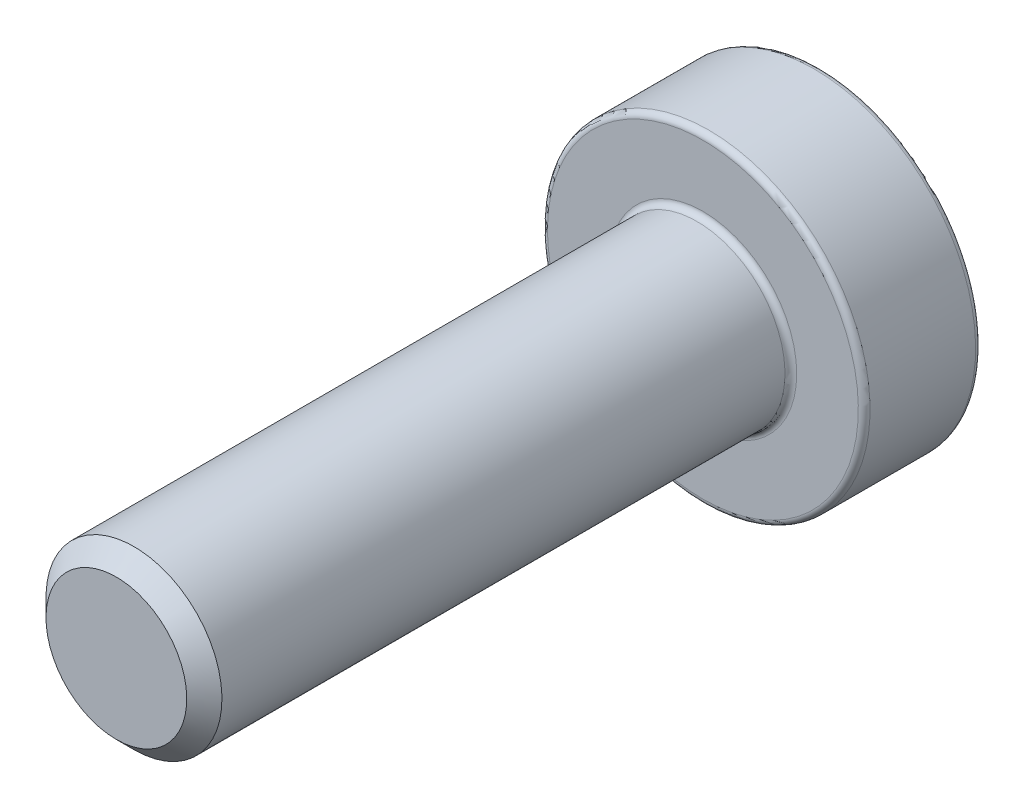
ISO-10303-21;
HEADER;
FILE_DESCRIPTION(('STEP AP214'),'2;1');
FILE_NAME('part.step','',(''),(''),'','','');
FILE_SCHEMA(('AUTOMOTIVE_DESIGN { 1 0 10303 214 1 1 1 1 }'));
ENDSEC;
DATA;
#1=APPLICATION_CONTEXT('core data for automotive mechanical design processes');
#2=APPLICATION_PROTOCOL_DEFINITION('international standard','automotive_design',2000,#1);
#3=PRODUCT_CONTEXT('',#1,'mechanical');
#4=PRODUCT('Part','Part','',(#3));
#5=PRODUCT_RELATED_PRODUCT_CATEGORY('part','',(#4));
#6=PRODUCT_DEFINITION_FORMATION('','',#4);
#7=PRODUCT_DEFINITION_CONTEXT('part definition',#1,'design');
#8=PRODUCT_DEFINITION('design','',#6,#7);
#9=PRODUCT_DEFINITION_SHAPE('','',#8);
#10=(LENGTH_UNIT() NAMED_UNIT(*) SI_UNIT(.MILLI.,.METRE.));
#11=(NAMED_UNIT(*) PLANE_ANGLE_UNIT() SI_UNIT($,.RADIAN.));
#12=(NAMED_UNIT(*) SI_UNIT($,.STERADIAN.) SOLID_ANGLE_UNIT());
#13=UNCERTAINTY_MEASURE_WITH_UNIT(LENGTH_MEASURE(1.E-05),#10,'distance_accuracy_value','');
#14=(GEOMETRIC_REPRESENTATION_CONTEXT(3) GLOBAL_UNCERTAINTY_ASSIGNED_CONTEXT((#13)) GLOBAL_UNIT_ASSIGNED_CONTEXT((#10,
#11,#12)) REPRESENTATION_CONTEXT('',''));
#15=CARTESIAN_POINT('',(0.,0.,0.));
#16=DIRECTION('',(0.,0.,1.));
#17=DIRECTION('',(1.,0.,0.));
#18=AXIS2_PLACEMENT_3D('',#15,#16,#17);
#19=CARTESIAN_POINT('',(0.,2.75,-2.));
#20=DIRECTION('',(0.,0.,-1.));
#21=DIRECTION('',(0.,1.,0.));
#22=AXIS2_PLACEMENT_3D('',#19,#20,#21);
#23=PLANE('',#22);
#24=CARTESIAN_POINT('',(1.575,0.,-2.));
#25=DIRECTION('',(0.,0.,1.));
#26=DIRECTION('',(0.,1.,0.));
#27=AXIS2_PLACEMENT_3D('',#24,#25,#26);
#28=CIRCLE('',#27,0.55);
#29=CARTESIAN_POINT('',(1.31369047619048,0.48396005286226,-2.));
#30=VERTEX_POINT('',#29);
#31=CARTESIAN_POINT('',(1.31369047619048,-0.483960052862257,-2.));
#32=VERTEX_POINT('',#31);
#33=EDGE_CURVE('E183',#30,#32,#28,.T.);
#34=ORIENTED_EDGE('',*,*,#33,.F.);
#35=CARTESIAN_POINT('',(0.,0.,-2.));
#36=DIRECTION('',(0.,0.,-1.));
#37=DIRECTION('',(0.,1.,0.));
#38=AXIS2_PLACEMENT_3D('',#35,#36,#37);
#39=CIRCLE('',#38,1.4);
#40=CARTESIAN_POINT('',(1.07596693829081,0.895709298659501,-2.));
#41=VERTEX_POINT('',#40);
#42=EDGE_CURVE('E180',#41,#30,#39,.T.);
#43=ORIENTED_EDGE('',*,*,#42,.F.);
#44=CARTESIAN_POINT('',(0.787499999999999,1.36399001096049,-2.));
#45=DIRECTION('',(0.,0.,1.));
#46=DIRECTION('',(0.,1.,0.));
#47=AXIS2_PLACEMENT_3D('',#44,#45,#46);
#48=CIRCLE('',#47,0.55);
#49=CARTESIAN_POINT('',(0.237723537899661,1.37966935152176,-2.));
#50=VERTEX_POINT('',#49);
#51=EDGE_CURVE('E178',#50,#41,#48,.T.);
#52=ORIENTED_EDGE('',*,*,#51,.F.);
#53=CARTESIAN_POINT('',(0.,0.,-2.));
#54=DIRECTION('',(0.,0.,-1.));
#55=DIRECTION('',(0.,1.,0.));
#56=AXIS2_PLACEMENT_3D('',#53,#54,#55);
#57=CIRCLE('',#56,1.4);
#58=CARTESIAN_POINT('',(-0.237723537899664,1.37966935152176,-2.));
#59=VERTEX_POINT('',#58);
#60=EDGE_CURVE('E175',#59,#50,#57,.T.);
#61=ORIENTED_EDGE('',*,*,#60,.F.);
#62=CARTESIAN_POINT('',(-0.787500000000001,1.36399001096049,-2.));
#63=DIRECTION('',(0.,0.,1.));
#64=DIRECTION('',(0.,1.,0.));
#65=AXIS2_PLACEMENT_3D('',#62,#63,#64);
#66=CIRCLE('',#65,0.55);
#67=CARTESIAN_POINT('',(-1.07596693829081,0.895709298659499,-2.));
#68=VERTEX_POINT('',#67);
#69=EDGE_CURVE('E173',#68,#59,#66,.T.);
#70=ORIENTED_EDGE('',*,*,#69,.F.);
#71=CARTESIAN_POINT('',(0.,0.,-2.));
#72=DIRECTION('',(0.,0.,-1.));
#73=DIRECTION('',(0.,1.,0.));
#74=AXIS2_PLACEMENT_3D('',#71,#72,#73);
#75=CIRCLE('',#74,1.4);
#76=CARTESIAN_POINT('',(-1.31369047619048,0.483960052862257,-2.));
#77=VERTEX_POINT('',#76);
#78=EDGE_CURVE('E170',#77,#68,#75,.T.);
#79=ORIENTED_EDGE('',*,*,#78,.F.);
#80=CARTESIAN_POINT('',(-1.575,0.,-2.));
#81=DIRECTION('',(0.,0.,1.));
#82=DIRECTION('',(0.,1.,0.));
#83=AXIS2_PLACEMENT_3D('',#80,#81,#82);
#84=CIRCLE('',#83,0.55);
#85=CARTESIAN_POINT('',(-1.31369047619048,-0.48396005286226,-2.));
#86=VERTEX_POINT('',#85);
#87=EDGE_CURVE('E168',#86,#77,#84,.T.);
#88=ORIENTED_EDGE('',*,*,#87,.F.);
#89=CARTESIAN_POINT('',(0.,0.,-2.));
#90=DIRECTION('',(0.,0.,-1.));
#91=DIRECTION('',(0.,1.,0.));
#92=AXIS2_PLACEMENT_3D('',#89,#90,#91);
#93=CIRCLE('',#92,1.4);
#94=CARTESIAN_POINT('',(-1.07596693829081,-0.895709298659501,-2.));
#95=VERTEX_POINT('',#94);
#96=EDGE_CURVE('E144',#95,#86,#93,.T.);
#97=ORIENTED_EDGE('',*,*,#96,.F.);
#98=CARTESIAN_POINT('',(-0.787499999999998,-1.36399001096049,-2.));
#99=DIRECTION('',(0.,0.,1.));
#100=DIRECTION('',(0.,1.,0.));
#101=AXIS2_PLACEMENT_3D('',#98,#99,#100);
#102=CIRCLE('',#101,0.55);
#103=CARTESIAN_POINT('',(-0.237723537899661,-1.37966935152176,-2.));
#104=VERTEX_POINT('',#103);
#105=EDGE_CURVE('E138',#104,#95,#102,.T.);
#106=ORIENTED_EDGE('',*,*,#105,.F.);
#107=CARTESIAN_POINT('',(0.,0.,-2.));
#108=DIRECTION('',(0.,0.,-1.));
#109=DIRECTION('',(0.,1.,0.));
#110=AXIS2_PLACEMENT_3D('',#107,#108,#109);
#111=CIRCLE('',#110,1.4);
#112=CARTESIAN_POINT('',(0.237723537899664,-1.37966935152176,-2.));
#113=VERTEX_POINT('',#112);
#114=EDGE_CURVE('E142',#113,#104,#111,.T.);
#115=ORIENTED_EDGE('',*,*,#114,.F.);
#116=CARTESIAN_POINT('',(0.787500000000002,-1.36399001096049,-2.));
#117=DIRECTION('',(0.,0.,1.));
#118=DIRECTION('',(0.,1.,0.));
#119=AXIS2_PLACEMENT_3D('',#116,#117,#118);
#120=CIRCLE('',#119,0.55);
#121=CARTESIAN_POINT('',(1.07596693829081,-0.895709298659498,-2.));
#122=VERTEX_POINT('',#121);
#123=EDGE_CURVE('E188',#122,#113,#120,.T.);
#124=ORIENTED_EDGE('',*,*,#123,.F.);
#125=CARTESIAN_POINT('',(0.,0.,-2.));
#126=DIRECTION('',(0.,0.,-1.));
#127=DIRECTION('',(0.,1.,0.));
#128=AXIS2_PLACEMENT_3D('',#125,#126,#127);
#129=CIRCLE('',#128,1.4);
#130=EDGE_CURVE('E185',#32,#122,#129,.T.);
#131=ORIENTED_EDGE('',*,*,#130,.F.);
#132=EDGE_LOOP('',(#34,#43,#52,#61,#70,#79,#88,#97,#106,#115,#124,#131));
#133=FACE_BOUND('',#132,.T.);
#134=CARTESIAN_POINT('',(0.,0.,-2.));
#135=DIRECTION('',(0.,0.,-1.));
#136=DIRECTION('',(0.,1.,0.));
#137=AXIS2_PLACEMENT_3D('',#134,#135,#136);
#138=CIRCLE('',#137,2.65);
#139=CARTESIAN_POINT('',(0.,2.65,-2.));
#140=VERTEX_POINT('',#139);
#141=EDGE_CURVE('E257',#140,#140,#138,.T.);
#142=ORIENTED_EDGE('',*,*,#141,.T.);
#143=EDGE_LOOP('',(#142));
#144=FACE_BOUND('',#143,.T.);
#145=ADVANCED_FACE('F31',(#133,#144),#23,.T.);
#146=CARTESIAN_POINT('',(0.,0.,-2.));
#147=DIRECTION('',(0.,0.,-1.));
#148=DIRECTION('',(0.,1.,0.));
#149=AXIS2_PLACEMENT_3D('',#146,#147,#148);
#150=CYLINDRICAL_SURFACE('',#149,2.75);
#151=CARTESIAN_POINT('',(0.,0.,-1.9));
#152=DIRECTION('',(0.,0.,-1.));
#153=DIRECTION('',(0.,1.,0.));
#154=AXIS2_PLACEMENT_3D('',#151,#152,#153);
#155=CIRCLE('',#154,2.75);
#156=CARTESIAN_POINT('',(0.,2.75,-1.9));
#157=VERTEX_POINT('',#156);
#158=EDGE_CURVE('E264',#157,#157,#155,.F.);
#159=ORIENTED_EDGE('',*,*,#158,.T.);
#160=EDGE_LOOP('',(#159));
#161=FACE_BOUND('',#160,.T.);
#162=CARTESIAN_POINT('',(0.,0.,-0.1));
#163=DIRECTION('',(0.,0.,1.));
#164=DIRECTION('',(0.,-1.,0.));
#165=AXIS2_PLACEMENT_3D('',#162,#163,#164);
#166=CIRCLE('',#165,2.75);
#167=CARTESIAN_POINT('',(0.,-2.75,-0.100000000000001));
#168=VERTEX_POINT('',#167);
#169=EDGE_CURVE('E261',#168,#168,#166,.F.);
#170=ORIENTED_EDGE('',*,*,#169,.T.);
#171=EDGE_LOOP('',(#170));
#172=FACE_BOUND('',#171,.T.);
#173=ADVANCED_FACE('F294',(#161,#172),#150,.T.);
#174=CARTESIAN_POINT('',(0.,1.5,0.));
#175=DIRECTION('',(0.,0.,1.));
#176=DIRECTION('',(0.,-1.,0.));
#177=AXIS2_PLACEMENT_3D('',#174,#175,#176);
#178=PLANE('',#177);
#179=CARTESIAN_POINT('',(0.,0.,0.));
#180=DIRECTION('',(0.,0.,1.));
#181=DIRECTION('',(0.,-1.,0.));
#182=AXIS2_PLACEMENT_3D('',#179,#180,#181);
#183=CIRCLE('',#182,2.65);
#184=CARTESIAN_POINT('',(0.,-2.65,0.));
#185=VERTEX_POINT('',#184);
#186=EDGE_CURVE('E270',#185,#185,#183,.T.);
#187=ORIENTED_EDGE('',*,*,#186,.T.);
#188=EDGE_LOOP('',(#187));
#189=FACE_BOUND('',#188,.T.);
#190=CARTESIAN_POINT('',(0.,0.,0.));
#191=DIRECTION('',(0.,0.,1.));
#192=DIRECTION('',(0.,-1.,0.));
#193=AXIS2_PLACEMENT_3D('',#190,#191,#192);
#194=CIRCLE('',#193,1.6);
#195=CARTESIAN_POINT('',(0.,-1.6,0.));
#196=VERTEX_POINT('',#195);
#197=EDGE_CURVE('E267',#196,#196,#194,.F.);
#198=ORIENTED_EDGE('',*,*,#197,.T.);
#199=EDGE_LOOP('',(#198));
#200=FACE_BOUND('',#199,.T.);
#201=ADVANCED_FACE('F298',(#189,#200),#178,.T.);
#202=CARTESIAN_POINT('',(0.,0.,-2.));
#203=DIRECTION('',(0.,0.,-1.));
#204=DIRECTION('',(0.,1.,0.));
#205=AXIS2_PLACEMENT_3D('',#202,#203,#204);
#206=CYLINDRICAL_SURFACE('',#205,1.5);
#207=CARTESIAN_POINT('',(0.,0.,9.7));
#208=DIRECTION('',(0.,0.,1.));
#209=DIRECTION('',(0.,-1.,0.));
#210=AXIS2_PLACEMENT_3D('',#207,#208,#209);
#211=CIRCLE('',#210,1.5);
#212=CARTESIAN_POINT('',(0.,-1.5,9.7));
#213=VERTEX_POINT('',#212);
#214=EDGE_CURVE('E38',#213,#213,#211,.F.);
#215=ORIENTED_EDGE('',*,*,#214,.T.);
#216=EDGE_LOOP('',(#215));
#217=FACE_BOUND('',#216,.T.);
#218=CARTESIAN_POINT('',(0.,0.,0.0999999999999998));
#219=DIRECTION('',(0.,0.,1.));
#220=DIRECTION('',(0.,-1.,0.));
#221=AXIS2_PLACEMENT_3D('',#218,#219,#220);
#222=CIRCLE('',#221,1.5);
#223=CARTESIAN_POINT('',(0.,-1.5,0.0999999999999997));
#224=VERTEX_POINT('',#223);
#225=EDGE_CURVE('E273',#224,#224,#222,.T.);
#226=ORIENTED_EDGE('',*,*,#225,.T.);
#227=EDGE_LOOP('',(#226));
#228=FACE_BOUND('',#227,.T.);
#229=ADVANCED_FACE('F278',(#217,#228),#206,.T.);
#230=CARTESIAN_POINT('',(0.,0.,10.));
#231=DIRECTION('',(0.,0.,1.));
#232=DIRECTION('',(0.,-1.,0.));
#233=AXIS2_PLACEMENT_3D('',#230,#231,#232);
#234=PLANE('',#233);
#235=CARTESIAN_POINT('',(0.,0.,10.));
#236=DIRECTION('',(0.,0.,1.));
#237=DIRECTION('',(0.,-1.,0.));
#238=AXIS2_PLACEMENT_3D('',#235,#236,#237);
#239=CIRCLE('',#238,1.2);
#240=CARTESIAN_POINT('',(0.,-1.2,10.));
#241=VERTEX_POINT('',#240);
#242=EDGE_CURVE('E11',#241,#241,#239,.T.);
#243=ORIENTED_EDGE('',*,*,#242,.T.);
#244=EDGE_LOOP('',(#243));
#245=FACE_BOUND('',#244,.T.);
#246=ADVANCED_FACE('F309',(#245),#234,.T.);
#247=CARTESIAN_POINT('',(0.,0.,-1.9));
#248=DIRECTION('',(0.,0.,-1.));
#249=DIRECTION('',(0.,1.,0.));
#250=AXIS2_PLACEMENT_3D('',#247,#248,#249);
#251=TOROIDAL_SURFACE('',#250,2.65,0.1);
#252=ORIENTED_EDGE('',*,*,#158,.F.);
#253=EDGE_LOOP('',(#252));
#254=FACE_BOUND('',#253,.T.);
#255=ORIENTED_EDGE('',*,*,#141,.F.);
#256=EDGE_LOOP('',(#255));
#257=FACE_BOUND('',#256,.T.);
#258=ADVANCED_FACE('F312',(#254,#257),#251,.T.);
#259=CARTESIAN_POINT('',(0.,0.,-0.1));
#260=DIRECTION('',(0.,0.,1.));
#261=DIRECTION('',(0.,-1.,0.));
#262=AXIS2_PLACEMENT_3D('',#259,#260,#261);
#263=TOROIDAL_SURFACE('',#262,2.65,0.1);
#264=ORIENTED_EDGE('',*,*,#186,.F.);
#265=EDGE_LOOP('',(#264));
#266=FACE_BOUND('',#265,.T.);
#267=ORIENTED_EDGE('',*,*,#169,.F.);
#268=EDGE_LOOP('',(#267));
#269=FACE_BOUND('',#268,.T.);
#270=ADVANCED_FACE('F316',(#266,#269),#263,.T.);
#271=CARTESIAN_POINT('',(0.,0.,0.0999999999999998));
#272=DIRECTION('',(0.,0.,1.));
#273=DIRECTION('',(0.,-1.,0.));
#274=AXIS2_PLACEMENT_3D('',#271,#272,#273);
#275=TOROIDAL_SURFACE('',#274,1.6,0.1);
#276=ORIENTED_EDGE('',*,*,#225,.F.);
#277=EDGE_LOOP('',(#276));
#278=FACE_BOUND('',#277,.T.);
#279=ORIENTED_EDGE('',*,*,#197,.F.);
#280=EDGE_LOOP('',(#279));
#281=FACE_BOUND('',#280,.T.);
#282=ADVANCED_FACE('F320',(#278,#281),#275,.F.);
#283=CARTESIAN_POINT('',(0.787500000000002,-1.36399001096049,-0.9));
#284=DIRECTION('',(0.,0.,-1.));
#285=DIRECTION('',(0.,1.,0.));
#286=AXIS2_PLACEMENT_3D('',#283,#284,#285);
#287=CYLINDRICAL_SURFACE('',#286,0.55);
#288=CARTESIAN_POINT('',(0.787500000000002,-1.36399001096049,-0.9));
#289=DIRECTION('',(0.,0.,1.));
#290=DIRECTION('',(0.,1.,0.));
#291=AXIS2_PLACEMENT_3D('',#288,#289,#290);
#292=CIRCLE('',#291,0.55);
#293=CARTESIAN_POINT('',(1.07596693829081,-0.895709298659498,-0.9));
#294=VERTEX_POINT('',#293);
#295=CARTESIAN_POINT('',(0.512500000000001,-0.887676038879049,-0.9));
#296=VERTEX_POINT('',#295);
#297=EDGE_CURVE('E159',#294,#296,#292,.T.);
#298=ORIENTED_EDGE('',*,*,#297,.F.);
#299=DIRECTION('',(0.,0.,-1.));
#300=VECTOR('',#299,1.);
#301=CARTESIAN_POINT('',(1.07596693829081,-0.895709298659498,-0.9));
#302=LINE('',#301,#300);
#303=EDGE_CURVE('E227',#294,#122,#302,.T.);
#304=ORIENTED_EDGE('',*,*,#303,.T.);
#305=ORIENTED_EDGE('',*,*,#123,.T.);
#306=DIRECTION('',(0.,0.,-1.));
#307=VECTOR('',#306,1.);
#308=CARTESIAN_POINT('',(0.237723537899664,-1.37966935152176,-0.9));
#309=LINE('',#308,#307);
#310=CARTESIAN_POINT('',(0.237723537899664,-1.37966935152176,-0.9));
#311=VERTEX_POINT('',#310);
#312=EDGE_CURVE('E164',#311,#113,#309,.T.);
#313=ORIENTED_EDGE('',*,*,#312,.F.);
#314=EDGE_CURVE('E222',#296,#311,#292,.T.);
#315=ORIENTED_EDGE('',*,*,#314,.F.);
#316=EDGE_LOOP('',(#298,#304,#305,#313,#315));
#317=FACE_BOUND('',#316,.T.);
#318=ADVANCED_FACE('F323',(#317),#287,.T.);
#319=CARTESIAN_POINT('',(1.575,0.,-0.9));
#320=DIRECTION('',(0.,0.,-1.));
#321=DIRECTION('',(0.,1.,0.));
#322=AXIS2_PLACEMENT_3D('',#319,#320,#321);
#323=CYLINDRICAL_SURFACE('',#322,0.55);
#324=CARTESIAN_POINT('',(1.575,0.,-0.9));
#325=DIRECTION('',(0.,0.,1.));
#326=DIRECTION('',(0.,1.,0.));
#327=AXIS2_PLACEMENT_3D('',#324,#325,#326);
#328=CIRCLE('',#327,0.55);
#329=CARTESIAN_POINT('',(1.31369047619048,0.48396005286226,-0.9));
#330=VERTEX_POINT('',#329);
#331=CARTESIAN_POINT('',(1.025,0.,-0.9));
#332=VERTEX_POINT('',#331);
#333=EDGE_CURVE('E216',#330,#332,#328,.T.);
#334=ORIENTED_EDGE('',*,*,#333,.F.);
#335=DIRECTION('',(0.,0.,-1.));
#336=VECTOR('',#335,1.);
#337=CARTESIAN_POINT('',(1.31369047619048,0.48396005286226,-0.9));
#338=LINE('',#337,#336);
#339=EDGE_CURVE('E233',#330,#30,#338,.T.);
#340=ORIENTED_EDGE('',*,*,#339,.T.);
#341=ORIENTED_EDGE('',*,*,#33,.T.);
#342=DIRECTION('',(0.,0.,-1.));
#343=VECTOR('',#342,1.);
#344=CARTESIAN_POINT('',(1.31369047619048,-0.483960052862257,-0.9));
#345=LINE('',#344,#343);
#346=CARTESIAN_POINT('',(1.31369047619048,-0.483960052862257,-0.9));
#347=VERTEX_POINT('',#346);
#348=EDGE_CURVE('E230',#347,#32,#345,.T.);
#349=ORIENTED_EDGE('',*,*,#348,.F.);
#350=EDGE_CURVE('E215',#332,#347,#328,.T.);
#351=ORIENTED_EDGE('',*,*,#350,.F.);
#352=EDGE_LOOP('',(#334,#340,#341,#349,#351));
#353=FACE_BOUND('',#352,.T.);
#354=ADVANCED_FACE('F356',(#353),#323,.T.);
#355=CARTESIAN_POINT('',(0.787499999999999,1.36399001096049,-0.9));
#356=DIRECTION('',(0.,0.,-1.));
#357=DIRECTION('',(0.,1.,0.));
#358=AXIS2_PLACEMENT_3D('',#355,#356,#357);
#359=CYLINDRICAL_SURFACE('',#358,0.55);
#360=CARTESIAN_POINT('',(0.787499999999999,1.36399001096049,-0.9));
#361=DIRECTION('',(0.,0.,1.));
#362=DIRECTION('',(0.,1.,0.));
#363=AXIS2_PLACEMENT_3D('',#360,#361,#362);
#364=CIRCLE('',#363,0.55);
#365=CARTESIAN_POINT('',(0.237723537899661,1.37966935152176,-0.9));
#366=VERTEX_POINT('',#365);
#367=CARTESIAN_POINT('',(0.512499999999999,0.88767603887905,-0.9));
#368=VERTEX_POINT('',#367);
#369=EDGE_CURVE('E45',#366,#368,#364,.T.);
#370=ORIENTED_EDGE('',*,*,#369,.F.);
#371=DIRECTION('',(0.,0.,-1.));
#372=VECTOR('',#371,1.);
#373=CARTESIAN_POINT('',(0.237723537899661,1.37966935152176,-0.9));
#374=LINE('',#373,#372);
#375=EDGE_CURVE('E239',#366,#50,#374,.T.);
#376=ORIENTED_EDGE('',*,*,#375,.T.);
#377=ORIENTED_EDGE('',*,*,#51,.T.);
#378=DIRECTION('',(0.,0.,-1.));
#379=VECTOR('',#378,1.);
#380=CARTESIAN_POINT('',(1.07596693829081,0.895709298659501,-0.9));
#381=LINE('',#380,#379);
#382=CARTESIAN_POINT('',(1.07596693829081,0.895709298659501,-0.9));
#383=VERTEX_POINT('',#382);
#384=EDGE_CURVE('E236',#383,#41,#381,.T.);
#385=ORIENTED_EDGE('',*,*,#384,.F.);
#386=EDGE_CURVE('E210',#368,#383,#364,.T.);
#387=ORIENTED_EDGE('',*,*,#386,.F.);
#388=EDGE_LOOP('',(#370,#376,#377,#385,#387));
#389=FACE_BOUND('',#388,.T.);
#390=ADVANCED_FACE('F348',(#389),#359,.T.);
#391=CARTESIAN_POINT('',(-0.787500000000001,1.36399001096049,-0.9));
#392=DIRECTION('',(0.,0.,-1.));
#393=DIRECTION('',(0.,1.,0.));
#394=AXIS2_PLACEMENT_3D('',#391,#392,#393);
#395=CYLINDRICAL_SURFACE('',#394,0.55);
#396=CARTESIAN_POINT('',(-0.787500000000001,1.36399001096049,-0.9));
#397=DIRECTION('',(0.,0.,1.));
#398=DIRECTION('',(0.,1.,0.));
#399=AXIS2_PLACEMENT_3D('',#396,#397,#398);
#400=CIRCLE('',#399,0.55);
#401=CARTESIAN_POINT('',(-1.07596693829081,0.895709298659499,-0.9));
#402=VERTEX_POINT('',#401);
#403=CARTESIAN_POINT('',(-0.512500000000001,0.887676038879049,-0.9));
#404=VERTEX_POINT('',#403);
#405=EDGE_CURVE('E205',#402,#404,#400,.T.);
#406=ORIENTED_EDGE('',*,*,#405,.F.);
#407=DIRECTION('',(0.,0.,-1.));
#408=VECTOR('',#407,1.);
#409=CARTESIAN_POINT('',(-1.07596693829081,0.895709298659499,-0.9));
#410=LINE('',#409,#408);
#411=EDGE_CURVE('E245',#402,#68,#410,.T.);
#412=ORIENTED_EDGE('',*,*,#411,.T.);
#413=ORIENTED_EDGE('',*,*,#69,.T.);
#414=DIRECTION('',(0.,0.,-1.));
#415=VECTOR('',#414,1.);
#416=CARTESIAN_POINT('',(-0.237723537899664,1.37966935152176,-0.9));
#417=LINE('',#416,#415);
#418=CARTESIAN_POINT('',(-0.237723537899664,1.37966935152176,-0.9));
#419=VERTEX_POINT('',#418);
#420=EDGE_CURVE('E242',#419,#59,#417,.T.);
#421=ORIENTED_EDGE('',*,*,#420,.F.);
#422=EDGE_CURVE('E204',#404,#419,#400,.T.);
#423=ORIENTED_EDGE('',*,*,#422,.F.);
#424=EDGE_LOOP('',(#406,#412,#413,#421,#423));
#425=FACE_BOUND('',#424,.T.);
#426=ADVANCED_FACE('F340',(#425),#395,.T.);
#427=CARTESIAN_POINT('',(-1.575,0.,-0.9));
#428=DIRECTION('',(0.,0.,-1.));
#429=DIRECTION('',(0.,1.,0.));
#430=AXIS2_PLACEMENT_3D('',#427,#428,#429);
#431=CYLINDRICAL_SURFACE('',#430,0.55);
#432=CARTESIAN_POINT('',(-1.575,0.,-0.9));
#433=DIRECTION('',(0.,0.,1.));
#434=DIRECTION('',(0.,1.,0.));
#435=AXIS2_PLACEMENT_3D('',#432,#433,#434);
#436=CIRCLE('',#435,0.55);
#437=CARTESIAN_POINT('',(-1.31369047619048,-0.48396005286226,-0.9));
#438=VERTEX_POINT('',#437);
#439=CARTESIAN_POINT('',(-1.025,0.,-0.9));
#440=VERTEX_POINT('',#439);
#441=EDGE_CURVE('E198',#438,#440,#436,.T.);
#442=ORIENTED_EDGE('',*,*,#441,.F.);
#443=DIRECTION('',(0.,0.,-1.));
#444=VECTOR('',#443,1.);
#445=CARTESIAN_POINT('',(-1.31369047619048,-0.48396005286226,-0.9));
#446=LINE('',#445,#444);
#447=EDGE_CURVE('E250',#438,#86,#446,.T.);
#448=ORIENTED_EDGE('',*,*,#447,.T.);
#449=ORIENTED_EDGE('',*,*,#87,.T.);
#450=DIRECTION('',(0.,0.,-1.));
#451=VECTOR('',#450,1.);
#452=CARTESIAN_POINT('',(-1.31369047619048,0.483960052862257,-0.9));
#453=LINE('',#452,#451);
#454=CARTESIAN_POINT('',(-1.31369047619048,0.483960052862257,-0.9));
#455=VERTEX_POINT('',#454);
#456=EDGE_CURVE('E247',#455,#77,#453,.T.);
#457=ORIENTED_EDGE('',*,*,#456,.F.);
#458=EDGE_CURVE('E197',#440,#455,#436,.T.);
#459=ORIENTED_EDGE('',*,*,#458,.F.);
#460=EDGE_LOOP('',(#442,#448,#449,#457,#459));
#461=FACE_BOUND('',#460,.T.);
#462=ADVANCED_FACE('F333',(#461),#431,.T.);
#463=CARTESIAN_POINT('',(-0.787499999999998,-1.36399001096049,-0.9));
#464=DIRECTION('',(0.,0.,-1.));
#465=DIRECTION('',(0.,1.,0.));
#466=AXIS2_PLACEMENT_3D('',#463,#464,#465);
#467=CYLINDRICAL_SURFACE('',#466,0.55);
#468=CARTESIAN_POINT('',(-0.787499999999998,-1.36399001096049,-0.9));
#469=DIRECTION('',(0.,0.,1.));
#470=DIRECTION('',(0.,1.,0.));
#471=AXIS2_PLACEMENT_3D('',#468,#469,#470);
#472=CIRCLE('',#471,0.55);
#473=CARTESIAN_POINT('',(-0.237723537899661,-1.37966935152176,-0.9));
#474=VERTEX_POINT('',#473);
#475=CARTESIAN_POINT('',(-0.512499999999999,-0.88767603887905,-0.9));
#476=VERTEX_POINT('',#475);
#477=EDGE_CURVE('E154',#474,#476,#472,.T.);
#478=ORIENTED_EDGE('',*,*,#477,.F.);
#479=DIRECTION('',(0.,0.,-1.));
#480=VECTOR('',#479,1.);
#481=CARTESIAN_POINT('',(-0.237723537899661,-1.37966935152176,-0.9));
#482=LINE('',#481,#480);
#483=EDGE_CURVE('E150',#474,#104,#482,.T.);
#484=ORIENTED_EDGE('',*,*,#483,.T.);
#485=ORIENTED_EDGE('',*,*,#105,.T.);
#486=DIRECTION('',(0.,0.,-1.));
#487=VECTOR('',#486,1.);
#488=CARTESIAN_POINT('',(-1.07596693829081,-0.895709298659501,-0.9));
#489=LINE('',#488,#487);
#490=CARTESIAN_POINT('',(-1.07596693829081,-0.895709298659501,-0.9));
#491=VERTEX_POINT('',#490);
#492=EDGE_CURVE('E158',#491,#95,#489,.T.);
#493=ORIENTED_EDGE('',*,*,#492,.F.);
#494=EDGE_CURVE('E192',#476,#491,#472,.T.);
#495=ORIENTED_EDGE('',*,*,#494,.F.);
#496=EDGE_LOOP('',(#478,#484,#485,#493,#495));
#497=FACE_BOUND('',#496,.T.);
#498=ADVANCED_FACE('F151',(#497),#467,.T.);
#499=CARTESIAN_POINT('',(-0.393749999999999,-0.681995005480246,-0.9));
#500=DIRECTION('',(0.,0.,-1.));
#501=DIRECTION('',(0.,1.,0.));
#502=AXIS2_PLACEMENT_3D('',#499,#500,#501);
#503=PLANE('',#502);
#504=CARTESIAN_POINT('',(0.,0.,-0.9));
#505=DIRECTION('',(0.,0.,-1.));
#506=DIRECTION('',(0.,1.,0.));
#507=AXIS2_PLACEMENT_3D('',#504,#505,#506);
#508=CIRCLE('',#507,1.025);
#509=EDGE_CURVE('E389',#440,#404,#508,.T.);
#510=ORIENTED_EDGE('',*,*,#509,.F.);
#511=ORIENTED_EDGE('',*,*,#458,.T.);
#512=CARTESIAN_POINT('',(0.,0.,-0.9));
#513=DIRECTION('',(0.,0.,-1.));
#514=DIRECTION('',(0.,1.,0.));
#515=AXIS2_PLACEMENT_3D('',#512,#513,#514);
#516=CIRCLE('',#515,1.4);
#517=EDGE_CURVE('E201',#455,#402,#516,.T.);
#518=ORIENTED_EDGE('',*,*,#517,.T.);
#519=ORIENTED_EDGE('',*,*,#405,.T.);
#520=EDGE_LOOP('',(#510,#511,#518,#519));
#521=FACE_BOUND('',#520,.T.);
#522=ADVANCED_FACE('F332',(#521),#503,.T.);
#523=EDGE_CURVE('E396',#476,#440,#508,.T.);
#524=ORIENTED_EDGE('',*,*,#523,.F.);
#525=ORIENTED_EDGE('',*,*,#494,.T.);
#526=CARTESIAN_POINT('',(0.,0.,-0.9));
#527=DIRECTION('',(0.,0.,-1.));
#528=DIRECTION('',(0.,1.,0.));
#529=AXIS2_PLACEMENT_3D('',#526,#527,#528);
#530=CIRCLE('',#529,1.4);
#531=EDGE_CURVE('E194',#491,#438,#530,.T.);
#532=ORIENTED_EDGE('',*,*,#531,.T.);
#533=ORIENTED_EDGE('',*,*,#441,.T.);
#534=EDGE_LOOP('',(#524,#525,#532,#533));
#535=FACE_BOUND('',#534,.T.);
#536=ADVANCED_FACE('F370',(#535),#503,.T.);
#537=EDGE_CURVE('E397',#296,#476,#508,.T.);
#538=ORIENTED_EDGE('',*,*,#537,.F.);
#539=ORIENTED_EDGE('',*,*,#314,.T.);
#540=CARTESIAN_POINT('',(0.,0.,-0.9));
#541=DIRECTION('',(0.,0.,-1.));
#542=DIRECTION('',(0.,1.,0.));
#543=AXIS2_PLACEMENT_3D('',#540,#541,#542);
#544=CIRCLE('',#543,1.4);
#545=EDGE_CURVE('E190',#311,#474,#544,.T.);
#546=ORIENTED_EDGE('',*,*,#545,.T.);
#547=ORIENTED_EDGE('',*,*,#477,.T.);
#548=EDGE_LOOP('',(#538,#539,#546,#547));
#549=FACE_BOUND('',#548,.T.);
#550=ADVANCED_FACE('F375',(#549),#503,.T.);
#551=EDGE_CURVE('E258',#332,#296,#508,.T.);
#552=ORIENTED_EDGE('',*,*,#551,.F.);
#553=ORIENTED_EDGE('',*,*,#350,.T.);
#554=CARTESIAN_POINT('',(0.,0.,-0.9));
#555=DIRECTION('',(0.,0.,-1.));
#556=DIRECTION('',(0.,1.,0.));
#557=AXIS2_PLACEMENT_3D('',#554,#555,#556);
#558=CIRCLE('',#557,1.4);
#559=EDGE_CURVE('E219',#347,#294,#558,.T.);
#560=ORIENTED_EDGE('',*,*,#559,.T.);
#561=ORIENTED_EDGE('',*,*,#297,.T.);
#562=EDGE_LOOP('',(#552,#553,#560,#561));
#563=FACE_BOUND('',#562,.T.);
#564=ADVANCED_FACE('F382',(#563),#503,.T.);
#565=EDGE_CURVE('E254',#368,#332,#508,.T.);
#566=ORIENTED_EDGE('',*,*,#565,.F.);
#567=ORIENTED_EDGE('',*,*,#386,.T.);
#568=CARTESIAN_POINT('',(0.,0.,-0.9));
#569=DIRECTION('',(0.,0.,-1.));
#570=DIRECTION('',(0.,1.,0.));
#571=AXIS2_PLACEMENT_3D('',#568,#569,#570);
#572=CIRCLE('',#571,1.4);
#573=EDGE_CURVE('E212',#383,#330,#572,.T.);
#574=ORIENTED_EDGE('',*,*,#573,.T.);
#575=ORIENTED_EDGE('',*,*,#333,.T.);
#576=EDGE_LOOP('',(#566,#567,#574,#575));
#577=FACE_BOUND('',#576,.T.);
#578=ADVANCED_FACE('F378',(#577),#503,.T.);
#579=EDGE_CURVE('E226',#404,#368,#508,.T.);
#580=ORIENTED_EDGE('',*,*,#579,.F.);
#581=ORIENTED_EDGE('',*,*,#422,.T.);
#582=CARTESIAN_POINT('',(0.,0.,-0.9));
#583=DIRECTION('',(0.,0.,-1.));
#584=DIRECTION('',(0.,1.,0.));
#585=AXIS2_PLACEMENT_3D('',#582,#583,#584);
#586=CIRCLE('',#585,1.4);
#587=EDGE_CURVE('E208',#419,#366,#586,.T.);
#588=ORIENTED_EDGE('',*,*,#587,.T.);
#589=ORIENTED_EDGE('',*,*,#369,.T.);
#590=EDGE_LOOP('',(#580,#581,#588,#589));
#591=FACE_BOUND('',#590,.T.);
#592=ADVANCED_FACE('F329',(#591),#503,.T.);
#593=CARTESIAN_POINT('',(0.,0.,-0.9));
#594=DIRECTION('',(0.,0.,-1.));
#595=DIRECTION('',(0.,1.,0.));
#596=AXIS2_PLACEMENT_3D('',#593,#594,#595);
#597=CYLINDRICAL_SURFACE('',#596,1.4);
#598=ORIENTED_EDGE('',*,*,#114,.T.);
#599=ORIENTED_EDGE('',*,*,#483,.F.);
#600=ORIENTED_EDGE('',*,*,#545,.F.);
#601=ORIENTED_EDGE('',*,*,#312,.T.);
#602=EDGE_LOOP('',(#598,#599,#600,#601));
#603=FACE_BOUND('',#602,.T.);
#604=ADVANCED_FACE('F162',(#603),#597,.F.);
#605=CARTESIAN_POINT('',(0.,0.,-0.9));
#606=DIRECTION('',(0.,0.,-1.));
#607=DIRECTION('',(0.,1.,0.));
#608=AXIS2_PLACEMENT_3D('',#605,#606,#607);
#609=CYLINDRICAL_SURFACE('',#608,1.4);
#610=ORIENTED_EDGE('',*,*,#130,.T.);
#611=ORIENTED_EDGE('',*,*,#303,.F.);
#612=ORIENTED_EDGE('',*,*,#559,.F.);
#613=ORIENTED_EDGE('',*,*,#348,.T.);
#614=EDGE_LOOP('',(#610,#611,#612,#613));
#615=FACE_BOUND('',#614,.T.);
#616=ADVANCED_FACE('F328',(#615),#609,.F.);
#617=CARTESIAN_POINT('',(0.,0.,-0.9));
#618=DIRECTION('',(0.,0.,-1.));
#619=DIRECTION('',(0.,1.,0.));
#620=AXIS2_PLACEMENT_3D('',#617,#618,#619);
#621=CYLINDRICAL_SURFACE('',#620,1.4);
#622=ORIENTED_EDGE('',*,*,#42,.T.);
#623=ORIENTED_EDGE('',*,*,#339,.F.);
#624=ORIENTED_EDGE('',*,*,#573,.F.);
#625=ORIENTED_EDGE('',*,*,#384,.T.);
#626=EDGE_LOOP('',(#622,#623,#624,#625));
#627=FACE_BOUND('',#626,.T.);
#628=ADVANCED_FACE('F352',(#627),#621,.F.);
#629=CARTESIAN_POINT('',(0.,0.,-0.9));
#630=DIRECTION('',(0.,0.,-1.));
#631=DIRECTION('',(0.,1.,0.));
#632=AXIS2_PLACEMENT_3D('',#629,#630,#631);
#633=CYLINDRICAL_SURFACE('',#632,1.4);
#634=ORIENTED_EDGE('',*,*,#60,.T.);
#635=ORIENTED_EDGE('',*,*,#375,.F.);
#636=ORIENTED_EDGE('',*,*,#587,.F.);
#637=ORIENTED_EDGE('',*,*,#420,.T.);
#638=EDGE_LOOP('',(#634,#635,#636,#637));
#639=FACE_BOUND('',#638,.T.);
#640=ADVANCED_FACE('F344',(#639),#633,.F.);
#641=CARTESIAN_POINT('',(0.,0.,-0.9));
#642=DIRECTION('',(0.,0.,-1.));
#643=DIRECTION('',(0.,1.,0.));
#644=AXIS2_PLACEMENT_3D('',#641,#642,#643);
#645=CYLINDRICAL_SURFACE('',#644,1.4);
#646=ORIENTED_EDGE('',*,*,#78,.T.);
#647=ORIENTED_EDGE('',*,*,#411,.F.);
#648=ORIENTED_EDGE('',*,*,#517,.F.);
#649=ORIENTED_EDGE('',*,*,#456,.T.);
#650=EDGE_LOOP('',(#646,#647,#648,#649));
#651=FACE_BOUND('',#650,.T.);
#652=ADVANCED_FACE('F336',(#651),#645,.F.);
#653=CARTESIAN_POINT('',(0.,0.,-0.9));
#654=DIRECTION('',(0.,0.,-1.));
#655=DIRECTION('',(0.,1.,0.));
#656=AXIS2_PLACEMENT_3D('',#653,#654,#655);
#657=CYLINDRICAL_SURFACE('',#656,1.4);
#658=ORIENTED_EDGE('',*,*,#96,.T.);
#659=ORIENTED_EDGE('',*,*,#447,.F.);
#660=ORIENTED_EDGE('',*,*,#531,.F.);
#661=ORIENTED_EDGE('',*,*,#492,.T.);
#662=EDGE_LOOP('',(#658,#659,#660,#661));
#663=FACE_BOUND('',#662,.T.);
#664=ADVANCED_FACE('F289',(#663),#657,.F.);
#665=CARTESIAN_POINT('',(0.,0.,-0.9));
#666=DIRECTION('',(0.,0.,-1.));
#667=DIRECTION('',(0.,1.,0.));
#668=AXIS2_PLACEMENT_3D('',#665,#666,#667);
#669=CONICAL_SURFACE('',#668,1.025,1.22173047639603);
#670=CARTESIAN_POINT('',(0.,0.,-0.526930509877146));
#671=VERTEX_POINT('',#670);
#672=VERTEX_LOOP('',#671);
#673=FACE_BOUND('',#672,.T.);
#674=ORIENTED_EDGE('',*,*,#565,.T.);
#675=ORIENTED_EDGE('',*,*,#551,.T.);
#676=ORIENTED_EDGE('',*,*,#537,.T.);
#677=ORIENTED_EDGE('',*,*,#523,.T.);
#678=ORIENTED_EDGE('',*,*,#509,.T.);
#679=ORIENTED_EDGE('',*,*,#579,.T.);
#680=EDGE_LOOP('',(#674,#675,#676,#677,#678,#679));
#681=FACE_BOUND('',#680,.T.);
#682=ADVANCED_FACE('F283',(#673,#681),#669,.F.);
#683=CARTESIAN_POINT('',(0.,0.,9.7));
#684=DIRECTION('',(0.,0.,-1.));
#685=DIRECTION('',(0.,1.,0.));
#686=AXIS2_PLACEMENT_3D('',#683,#684,#685);
#687=CONICAL_SURFACE('',#686,1.5,0.785398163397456);
#688=ORIENTED_EDGE('',*,*,#242,.F.);
#689=EDGE_LOOP('',(#688));
#690=FACE_BOUND('',#689,.T.);
#691=ORIENTED_EDGE('',*,*,#214,.F.);
#692=EDGE_LOOP('',(#691));
#693=FACE_BOUND('',#692,.T.);
#694=ADVANCED_FACE('F281',(#690,#693),#687,.T.);
#695=CLOSED_SHELL('',(#145,#173,#201,#229,#246,#258,#270,#282,#318,#354,#390,#426,#462,#498,
#522,#536,#550,#564,#578,#592,#604,#616,#628,#640,#652,#664,#682,#694));
#696=MANIFOLD_SOLID_BREP('B2',#695);
#697=ADVANCED_BREP_SHAPE_REPRESENTATION('',(#18,#696),#14);
#698=SHAPE_DEFINITION_REPRESENTATION(#9,#697);
ENDSEC;
END-ISO-10303-21;
